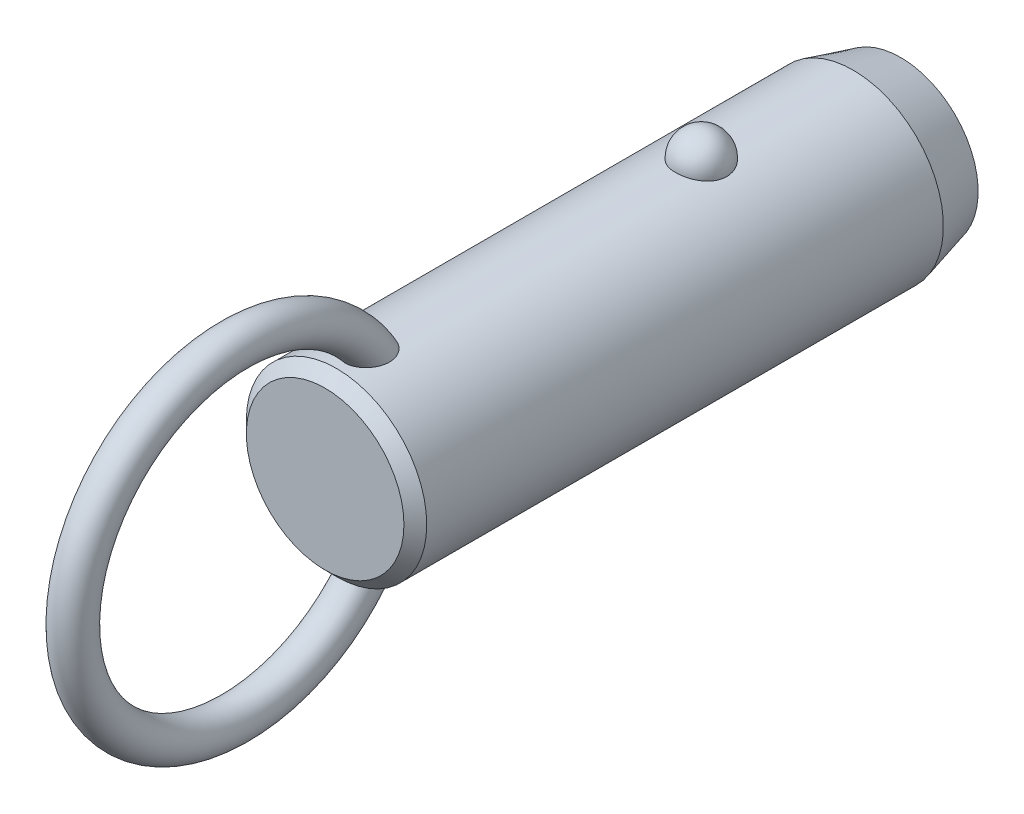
ISO-10303-21;
HEADER;
FILE_DESCRIPTION(('STEP AP214'),'2;1');
FILE_NAME('part.step','',(''),(''),'','','');
FILE_SCHEMA(('AUTOMOTIVE_DESIGN { 1 0 10303 214 1 1 1 1 }'));
ENDSEC;
DATA;
#1=APPLICATION_CONTEXT('core data for automotive mechanical design processes');
#2=APPLICATION_PROTOCOL_DEFINITION('international standard','automotive_design',2000,#1);
#3=PRODUCT_CONTEXT('',#1,'mechanical');
#4=PRODUCT('Part','Part','',(#3));
#5=PRODUCT_RELATED_PRODUCT_CATEGORY('part','',(#4));
#6=PRODUCT_DEFINITION_FORMATION('','',#4);
#7=PRODUCT_DEFINITION_CONTEXT('part definition',#1,'design');
#8=PRODUCT_DEFINITION('design','',#6,#7);
#9=PRODUCT_DEFINITION_SHAPE('','',#8);
#10=(LENGTH_UNIT() NAMED_UNIT(*) SI_UNIT(.MILLI.,.METRE.));
#11=(NAMED_UNIT(*) PLANE_ANGLE_UNIT() SI_UNIT($,.RADIAN.));
#12=(NAMED_UNIT(*) SI_UNIT($,.STERADIAN.) SOLID_ANGLE_UNIT());
#13=UNCERTAINTY_MEASURE_WITH_UNIT(LENGTH_MEASURE(1.E-05),#10,'distance_accuracy_value','');
#14=(GEOMETRIC_REPRESENTATION_CONTEXT(3) GLOBAL_UNCERTAINTY_ASSIGNED_CONTEXT((#13)) GLOBAL_UNIT_ASSIGNED_CONTEXT((#10,
#11,#12)) REPRESENTATION_CONTEXT('',''));
#15=CARTESIAN_POINT('',(0.,0.,0.));
#16=DIRECTION('',(0.,0.,1.));
#17=DIRECTION('',(1.,0.,0.));
#18=AXIS2_PLACEMENT_3D('',#15,#16,#17);
#19=CARTESIAN_POINT('',(0.,0.,27.4));
#20=DIRECTION('',(0.,0.,-1.));
#21=DIRECTION('',(-1.,0.,0.));
#22=AXIS2_PLACEMENT_3D('',#19,#20,#21);
#23=CYLINDRICAL_SURFACE('',#22,9.5);
#24=CARTESIAN_POINT('',(2.67259918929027,9.11631578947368,-2.70000000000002));
#25=CARTESIAN_POINT('',(2.6725968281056,9.11631786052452,-2.54909854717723));
#26=CARTESIAN_POINT('',(2.66030567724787,9.11994722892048,-2.39816735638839));
#27=CARTESIAN_POINT('',(2.6114347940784,9.13405924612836,-2.10058568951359));
#28=CARTESIAN_POINT('',(2.57484658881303,9.14454428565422,-1.95393672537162));
#29=CARTESIAN_POINT('',(2.47830875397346,9.17117631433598,-1.66916069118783));
#30=CARTESIAN_POINT('',(2.41836936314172,9.18732082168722,-1.53102991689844));
#31=CARTESIAN_POINT('',(2.27661331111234,9.22346780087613,-1.26705393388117));
#32=CARTESIAN_POINT('',(2.19479699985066,9.24347021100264,-1.14120852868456));
#33=CARTESIAN_POINT('',(2.01085282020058,9.28522401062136,-0.904632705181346));
#34=CARTESIAN_POINT('',(1.90862396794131,9.30698376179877,-0.793982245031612));
#35=CARTESIAN_POINT('',(1.6867437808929,9.34973971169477,-0.591607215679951));
#36=CARTESIAN_POINT('',(1.56709244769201,9.37073591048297,-0.499882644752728));
#37=CARTESIAN_POINT('',(1.31393976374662,9.40956370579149,-0.338167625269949));
#38=CARTESIAN_POINT('',(1.18048026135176,9.42740444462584,-0.268113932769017));
#39=CARTESIAN_POINT('',(0.903154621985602,9.45799906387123,-0.151390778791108));
#40=CARTESIAN_POINT('',(0.759289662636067,9.47075351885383,-0.104718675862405));
#41=CARTESIAN_POINT('',(0.46807402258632,9.48956256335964,-0.0367633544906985));
#42=CARTESIAN_POINT('',(0.320836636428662,9.49573643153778,-0.0150275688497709));
#43=CARTESIAN_POINT('',(0.02467145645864,9.50112183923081,0.00396199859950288));
#44=CARTESIAN_POINT('',(-0.124256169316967,9.50033406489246,0.00121819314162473));
#45=CARTESIAN_POINT('',(-0.417264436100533,9.4919475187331,-0.0284441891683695));
#46=CARTESIAN_POINT('',(-0.561384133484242,9.48444885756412,-0.0550074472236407));
#47=CARTESIAN_POINT('',(-0.842986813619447,9.46357853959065,-0.131064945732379));
#48=CARTESIAN_POINT('',(-0.98046968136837,9.450206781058,-0.180559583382));
#49=CARTESIAN_POINT('',(-1.24585005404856,9.41890822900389,-0.301476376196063));
#50=CARTESIAN_POINT('',(-1.37368611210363,9.40095498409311,-0.373026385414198));
#51=CARTESIAN_POINT('',(-1.61552738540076,9.36242964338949,-0.536025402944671));
#52=CARTESIAN_POINT('',(-1.72953116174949,9.34185727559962,-0.627476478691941));
#53=CARTESIAN_POINT('',(-1.9429225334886,9.29984568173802,-0.829844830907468));
#54=CARTESIAN_POINT('',(-2.04198021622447,9.27839736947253,-0.941108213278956));
#55=CARTESIAN_POINT('',(-2.2202646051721,9.23735994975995,-1.17883414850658));
#56=CARTESIAN_POINT('',(-2.29948985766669,9.21777097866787,-1.30529781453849));
#57=CARTESIAN_POINT('',(-2.43697287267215,9.18238994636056,-1.57158566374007));
#58=CARTESIAN_POINT('',(-2.49497068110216,9.16664569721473,-1.71155057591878));
#59=CARTESIAN_POINT('',(-2.5872073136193,9.14104303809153,-1.99961197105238));
#60=CARTESIAN_POINT('',(-2.62144683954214,9.13118445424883,-2.1477082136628));
#61=CARTESIAN_POINT('',(-2.66521466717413,9.11850622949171,-2.44715424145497));
#62=CARTESIAN_POINT('',(-2.67484831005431,9.11565658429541,-2.59848735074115));
#63=CARTESIAN_POINT('',(-2.66946735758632,9.11723375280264,-2.90067317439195));
#64=CARTESIAN_POINT('',(-2.65445345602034,9.12166036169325,-3.05152590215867));
#65=CARTESIAN_POINT('',(-2.6002971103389,9.13724422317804,-3.34766110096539));
#66=CARTESIAN_POINT('',(-2.56127978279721,9.14836656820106,-3.49296833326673));
#67=CARTESIAN_POINT('',(-2.46018844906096,9.17606676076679,-3.77477535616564));
#68=CARTESIAN_POINT('',(-2.39811349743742,9.19264483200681,-3.91127478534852));
#69=CARTESIAN_POINT('',(-2.25202303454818,9.22952198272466,-4.17244273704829));
#70=CARTESIAN_POINT('',(-2.16788714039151,9.24984129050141,-4.29704106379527));
#71=CARTESIAN_POINT('',(-1.9799408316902,9.29188255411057,-4.53013066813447));
#72=CARTESIAN_POINT('',(-1.87612963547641,9.31360456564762,-4.63862130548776));
#73=CARTESIAN_POINT('',(-1.65105429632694,9.35612959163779,-4.83690299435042));
#74=CARTESIAN_POINT('',(-1.52972405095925,9.37692871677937,-4.9266199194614));
#75=CARTESIAN_POINT('',(-1.27318250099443,9.41518970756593,-5.08429106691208));
#76=CARTESIAN_POINT('',(-1.13797219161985,9.432651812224,-5.15224684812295));
#77=CARTESIAN_POINT('',(-0.859280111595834,9.46208255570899,-5.26371827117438));
#78=CARTESIAN_POINT('',(-0.715925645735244,9.47411833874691,-5.30753421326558));
#79=CARTESIAN_POINT('',(-0.423550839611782,9.4916822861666,-5.37076321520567));
#80=CARTESIAN_POINT('',(-0.274531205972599,9.49721125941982,-5.39017930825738));
#81=CARTESIAN_POINT('',(0.0218446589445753,9.50110860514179,-5.40390587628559));
#82=CARTESIAN_POINT('',(0.16917707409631,9.49961381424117,-5.39869609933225));
#83=CARTESIAN_POINT('',(0.460808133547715,9.48993906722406,-5.36441955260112));
#84=CARTESIAN_POINT('',(0.605106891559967,9.48175936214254,-5.33535367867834));
#85=CARTESIAN_POINT('',(0.886027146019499,9.4596376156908,-5.25435587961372));
#86=CARTESIAN_POINT('',(1.02267710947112,9.44571881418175,-5.20251612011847));
#87=CARTESIAN_POINT('',(1.28523827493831,9.41358993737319,-5.07741549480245));
#88=CARTESIAN_POINT('',(1.41114877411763,9.39537958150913,-5.00415322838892));
#89=CARTESIAN_POINT('',(1.65085227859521,9.3562644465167,-4.8368459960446));
#90=CARTESIAN_POINT('',(1.76442346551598,9.33532178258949,-4.74249218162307));
#91=CARTESIAN_POINT('',(1.97425672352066,9.29321198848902,-4.53620389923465));
#92=CARTESIAN_POINT('',(2.07051582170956,9.27204482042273,-4.42426641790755));
#93=CARTESIAN_POINT('',(2.24490086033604,9.23139221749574,-4.18363183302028));
#94=CARTESIAN_POINT('',(2.32267019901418,9.21194380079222,-4.05466990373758));
#95=CARTESIAN_POINT('',(2.45584092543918,9.1773419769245,-3.78517836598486));
#96=CARTESIAN_POINT('',(2.51124979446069,9.16218713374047,-3.644652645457));
#97=CARTESIAN_POINT('',(2.59380876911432,9.13913522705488,-3.37104301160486));
#98=CARTESIAN_POINT('',(2.62330266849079,9.13064624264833,-3.23871053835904));
#99=CARTESIAN_POINT('',(2.66269870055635,9.11923566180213,-2.97092664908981));
#100=CARTESIAN_POINT('',(2.67260130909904,9.11631393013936,-2.83547530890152));
#101=CARTESIAN_POINT('',(2.67259918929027,9.11631578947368,-2.70000000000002));
#102=B_SPLINE_CURVE_WITH_KNOTS('',3,(#24,#25,#26,#27,#28,#29,#30,#31,#32,#33,#34,#35,#36,#37,
#38,#39,#40,#41,#42,#43,#44,#45,#46,#47,#48,#49,#50,#51,#52,#53,#54,#55,#56,#57,#58,#59,#60,#61,
#62,#63,#64,#65,#66,#67,#68,#69,#70,#71,#72,#73,#74,#75,#76,#77,#78,#79,#80,#81,#82,#83,#84,#85,
#86,#87,#88,#89,#90,#91,#92,#93,#94,#95,#96,#97,#98,#99,#100,#101),.UNSPECIFIED.,.T.,.F.,(4,2,2,
2,2,2,2,2,2,2,2,2,2,2,2,2,2,2,2,2,2,2,2,2,2,2,2,2,2,2,2,2,2,2,2,2,2,2,4),(0.,0.452217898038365,
0.904593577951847,1.35677112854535,1.80894144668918,2.26340676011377,2.71787203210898,
3.17099820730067,3.62407318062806,4.0687883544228,4.51345969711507,4.95160616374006,
5.38976021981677,5.83050358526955,6.27129275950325,6.72071308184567,7.17016633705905,
7.62495278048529,8.07972578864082,8.53254856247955,8.98535859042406,9.43582813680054,
9.88631615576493,10.3393155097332,10.7923328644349,11.2471065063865,11.7018475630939,
12.150795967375,12.5996885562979,13.0398725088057,13.4800399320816,13.9184421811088,
14.3568730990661,14.802202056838,15.2476074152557,15.7010097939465,16.1542603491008,
16.5602594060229,16.9662486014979),.UNSPECIFIED.);
#103=CARTESIAN_POINT('',(2.67259918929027,9.11631578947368,-2.70000000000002));
#104=VERTEX_POINT('',#103);
#105=EDGE_CURVE('E41',#104,#104,#102,.T.);
#106=ORIENTED_EDGE('',*,*,#105,.T.);
#107=EDGE_LOOP('',(#106));
#108=FACE_BOUND('',#107,.T.);
#109=CARTESIAN_POINT('',(0.,0.,35.72));
#110=DIRECTION('',(0.,0.,1.));
#111=DIRECTION('',(1.,0.,0.));
#112=AXIS2_PLACEMENT_3D('',#109,#110,#111);
#113=CIRCLE('',#112,9.5);
#114=CARTESIAN_POINT('',(9.5,0.,35.72));
#115=VERTEX_POINT('',#114);
#116=EDGE_CURVE('E10',#115,#115,#113,.F.);
#117=ORIENTED_EDGE('',*,*,#116,.T.);
#118=EDGE_LOOP('',(#117));
#119=FACE_BOUND('',#118,.T.);
#120=CARTESIAN_POINT('',(-0.69706210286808,-9.47439269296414,30.0678088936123));
#121=CARTESIAN_POINT('',(-0.799579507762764,-9.46685146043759,30.1074823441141));
#122=CARTESIAN_POINT('',(-0.898575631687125,-9.45788043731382,30.1559309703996));
#123=CARTESIAN_POINT('',(-1.08670047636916,-9.43811593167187,30.2688685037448));
#124=CARTESIAN_POINT('',(-1.17583204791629,-9.42732297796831,30.3333527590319));
#125=CARTESIAN_POINT('',(-1.34179806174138,-9.40513672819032,30.4762099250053));
#126=CARTESIAN_POINT('',(-1.41865133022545,-9.39374438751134,30.554561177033));
#127=CARTESIAN_POINT('',(-1.5586004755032,-9.37154196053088,30.7227524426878));
#128=CARTESIAN_POINT('',(-1.62169476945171,-9.3607319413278,30.8125937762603));
#129=CARTESIAN_POINT('',(-1.73527695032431,-9.34035749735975,31.0045001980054));
#130=CARTESIAN_POINT('',(-1.7852226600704,-9.33085270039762,31.1068910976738));
#131=CARTESIAN_POINT('',(-1.86924997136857,-9.3143834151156,31.318148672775));
#132=CARTESIAN_POINT('',(-1.90332570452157,-9.30741986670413,31.4270177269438));
#133=CARTESIAN_POINT('',(-1.95893603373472,-9.29588482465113,31.6604730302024));
#134=CARTESIAN_POINT('',(-1.97872420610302,-9.29165182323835,31.7854890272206));
#135=CARTESIAN_POINT('',(-2.00062129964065,-9.28695978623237,32.0370805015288));
#136=CARTESIAN_POINT('',(-2.00272284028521,-9.28650232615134,32.163656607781));
#137=CARTESIAN_POINT('',(-1.98958876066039,-9.28932750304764,32.4368157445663));
#138=CARTESIAN_POINT('',(-1.97143366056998,-9.2932400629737,32.5832519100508));
#139=CARTESIAN_POINT('',(-1.91479925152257,-9.30507151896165,32.8720629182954));
#140=CARTESIAN_POINT('',(-1.87629122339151,-9.31299607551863,33.0144317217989));
#141=CARTESIAN_POINT('',(-1.7722568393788,-9.33340232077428,33.3151725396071));
#142=CARTESIAN_POINT('',(-1.70334898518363,-9.34641636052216,33.4723691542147));
#143=CARTESIAN_POINT('',(-1.58111062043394,-9.36759153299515,33.6975171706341));
#144=CARTESIAN_POINT('',(-1.53721459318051,-9.37492619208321,33.7707968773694));
#145=CARTESIAN_POINT('',(-1.4430263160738,-9.38988566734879,33.9130740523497));
#146=CARTESIAN_POINT('',(-1.39273721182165,-9.39751033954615,33.9820736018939));
#147=CARTESIAN_POINT('',(-1.26775962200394,-9.41530678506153,34.1369832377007));
#148=CARTESIAN_POINT('',(-1.19052326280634,-9.42548108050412,34.2208712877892));
#149=CARTESIAN_POINT('',(-1.0242024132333,-9.44499825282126,34.3760086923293));
#150=CARTESIAN_POINT('',(-0.935139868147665,-9.45434261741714,34.4472808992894));
#151=CARTESIAN_POINT('',(-0.76661041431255,-9.46930670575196,34.5586955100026));
#152=CARTESIAN_POINT('',(-0.689439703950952,-9.47529223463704,34.6022354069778));
#153=CARTESIAN_POINT('',(-0.528942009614,-9.48560294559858,34.6763133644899));
#154=CARTESIAN_POINT('',(-0.445620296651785,-9.48992953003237,34.7068624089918));
#155=CARTESIAN_POINT('',(-0.27390112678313,-9.49644161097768,34.7525792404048));
#156=CARTESIAN_POINT('',(-0.185465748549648,-9.49860811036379,34.76761059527));
#157=CARTESIAN_POINT('',(-0.00734541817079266,-9.5004135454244,34.7801494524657));
#158=CARTESIAN_POINT('',(0.0823387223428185,-9.50005405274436,34.7776678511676));
#159=CARTESIAN_POINT('',(0.247679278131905,-9.49708301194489,34.7569959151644));
#160=CARTESIAN_POINT('',(0.323620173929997,-9.49477609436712,34.7409300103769));
#161=CARTESIAN_POINT('',(0.471981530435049,-9.48855917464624,34.6971726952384));
#162=CARTESIAN_POINT('',(0.544400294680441,-9.48464840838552,34.6694757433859));
#163=CARTESIAN_POINT('',(0.708947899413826,-9.47398336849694,34.5928026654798));
#164=CARTESIAN_POINT('',(0.799149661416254,-9.46671310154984,34.5397745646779));
#165=CARTESIAN_POINT('',(0.9697839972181,-9.4507622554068,34.4199731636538));
#166=CARTESIAN_POINT('',(1.05019415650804,-9.44207854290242,34.3531692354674));
#167=CARTESIAN_POINT('',(1.23092343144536,-9.42051459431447,34.1807596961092));
#168=CARTESIAN_POINT('',(1.32652499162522,-9.40733378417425,34.0702619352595));
#169=CARTESIAN_POINT('',(1.49893121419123,-9.38140745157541,33.8355614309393));
#170=CARTESIAN_POINT('',(1.57571616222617,-9.36866239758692,33.7113445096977));
#171=CARTESIAN_POINT('',(1.71285426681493,-9.34457644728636,33.4493891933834));
#172=CARTESIAN_POINT('',(1.77266365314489,-9.33328726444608,33.3113623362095));
#173=CARTESIAN_POINT('',(1.87239208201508,-9.31379209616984,33.0280515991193));
#174=CARTESIAN_POINT('',(1.91230158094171,-9.3055875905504,32.882764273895));
#175=CARTESIAN_POINT('',(1.9760418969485,-9.29228394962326,32.5620281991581));
#176=CARTESIAN_POINT('',(1.99587438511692,-9.28797202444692,32.3857248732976));
#177=CARTESIAN_POINT('',(2.0029570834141,-9.28645519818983,32.0324146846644));
#178=CARTESIAN_POINT('',(1.99025930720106,-9.28923895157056,31.8554093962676));
#179=CARTESIAN_POINT('',(1.93735479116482,-9.30038134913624,31.5563381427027));
#180=CARTESIAN_POINT('',(1.90576827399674,-9.30697680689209,31.4326679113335));
#181=CARTESIAN_POINT('',(1.82287484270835,-9.32356855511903,31.1923297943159));
#182=CARTESIAN_POINT('',(1.77158213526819,-9.33356239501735,31.0756569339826));
#183=CARTESIAN_POINT('',(1.64885744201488,-9.35602275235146,30.8527061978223));
#184=CARTESIAN_POINT('',(1.57730995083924,-9.36850332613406,30.7464927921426));
#185=CARTESIAN_POINT('',(1.41543264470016,-9.39431873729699,30.5495530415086));
#186=CARTESIAN_POINT('',(1.32510883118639,-9.40765330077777,30.4588217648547));
#187=CARTESIAN_POINT('',(1.13846223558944,-9.43195720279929,30.3050334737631));
#188=CARTESIAN_POINT('',(1.04369890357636,-9.44302894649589,30.2400947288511));
#189=CARTESIAN_POINT('',(0.84396568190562,-9.46296805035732,30.1280388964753));
#190=CARTESIAN_POINT('',(0.739000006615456,-9.4718363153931,30.0809144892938));
#191=CARTESIAN_POINT('',(0.528175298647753,-9.48586140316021,30.0081173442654));
#192=CARTESIAN_POINT('',(0.422686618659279,-9.49119633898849,29.9814024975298));
#193=CARTESIAN_POINT('',(0.208590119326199,-9.49831365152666,29.9460137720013));
#194=CARTESIAN_POINT('',(0.0999817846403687,-9.500095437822,29.9373428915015));
#195=CARTESIAN_POINT('',(-0.126104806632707,-9.49988861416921,29.9383501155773));
#196=CARTESIAN_POINT('',(-0.243578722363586,-9.49757821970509,29.9495942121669));
#197=CARTESIAN_POINT('',(-0.474390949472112,-9.48885165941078,29.993167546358));
#198=CARTESIAN_POINT('',(-0.58772905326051,-9.48243528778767,30.0254978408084));
#199=CARTESIAN_POINT('',(-0.69706210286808,-9.47439269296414,30.0678088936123));
#200=B_SPLINE_CURVE_WITH_KNOTS('',3,(#120,#121,#122,#123,#124,#125,#126,#127,#128,#129,#130,
#131,#132,#133,#134,#135,#136,#137,#138,#139,#140,#141,#142,#143,#144,#145,#146,#147,#148,#149,
#150,#151,#152,#153,#154,#155,#156,#157,#158,#159,#160,#161,#162,#163,#164,#165,#166,#167,#168,
#169,#170,#171,#172,#173,#174,#175,#176,#177,#178,#179,#180,#181,#182,#183,#184,#185,#186,#187,
#188,#189,#190,#191,#192,#193,#194,#195,#196,#197,#198,#199),.UNSPECIFIED.,.T.,.F.,(4,2,2,2,2,2,
2,2,2,2,2,2,2,2,2,2,2,2,2,2,2,2,2,2,2,2,2,2,2,2,2,2,2,2,2,2,2,2,2,4),(0.,0.330119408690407,
0.660143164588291,0.989655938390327,1.31920659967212,1.66074728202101,2.00241415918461,
2.38088696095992,2.75951768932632,3.20065679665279,3.64242004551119,4.15620996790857,
4.41314162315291,4.66994734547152,5.01228664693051,5.35399933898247,5.61943037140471,
5.88463652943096,6.15215502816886,6.41950709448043,6.65144391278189,6.88349136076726,
7.19641200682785,7.51003602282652,7.94779711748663,8.38601491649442,8.83699707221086,
9.28819530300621,9.81778662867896,10.3465317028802,10.7284172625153,11.1100280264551,
11.4938603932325,11.8775702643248,12.2220189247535,12.5663259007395,12.8915939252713,
13.2169159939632,13.5689650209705,13.9210316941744),.UNSPECIFIED.);
#201=CARTESIAN_POINT('',(-0.69706210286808,-9.47439269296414,30.0678088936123));
#202=VERTEX_POINT('',#201);
#203=EDGE_CURVE('E60',#202,#202,#200,.T.);
#204=ORIENTED_EDGE('',*,*,#203,.T.);
#205=EDGE_LOOP('',(#204));
#206=FACE_BOUND('',#205,.T.);
#207=CARTESIAN_POINT('',(-0.69706210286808,9.47439269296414,30.0678088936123));
#208=CARTESIAN_POINT('',(-0.597792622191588,9.48169483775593,30.0293956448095));
#209=CARTESIAN_POINT('',(-0.495106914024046,9.48766580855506,29.9991682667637));
#210=CARTESIAN_POINT('',(-0.285876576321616,9.49627648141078,29.9560327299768));
#211=CARTESIAN_POINT('',(-0.179324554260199,9.49890941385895,29.9431597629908));
#212=CARTESIAN_POINT('',(0.0344157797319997,9.50053798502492,29.9351666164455));
#213=CARTESIAN_POINT('',(0.141603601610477,9.49953613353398,29.9400341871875));
#214=CARTESIAN_POINT('',(0.353563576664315,9.49401038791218,29.9673654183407));
#215=CARTESIAN_POINT('',(0.45833679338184,9.48948807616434,29.98982117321));
#216=CARTESIAN_POINT('',(0.662493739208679,9.4774236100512,30.0516719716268));
#217=CARTESIAN_POINT('',(0.761881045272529,9.46988348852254,30.0910556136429));
#218=CARTESIAN_POINT('',(0.95260839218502,9.45260382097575,30.1856342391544));
#219=CARTESIAN_POINT('',(1.04394806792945,9.44286417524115,30.2408299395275));
#220=CARTESIAN_POINT('',(1.21712767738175,9.4221176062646,30.3660662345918));
#221=CARTESIAN_POINT('',(1.29885671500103,9.41109835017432,30.4362579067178));
#222=CARTESIAN_POINT('',(1.4497897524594,9.38903310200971,30.588980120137));
#223=CARTESIAN_POINT('',(1.51899278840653,9.37798710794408,30.6715116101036));
#224=CARTESIAN_POINT('',(1.64602857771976,9.35654375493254,30.8497763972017));
#225=CARTESIAN_POINT('',(1.70333052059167,9.34618688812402,30.9458916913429));
#226=CARTESIAN_POINT('',(1.80259341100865,9.32755128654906,31.145897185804));
#227=CARTESIAN_POINT('',(1.84454942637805,9.31927322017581,31.2497898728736));
#228=CARTESIAN_POINT('',(1.91637039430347,9.30478365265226,31.4722131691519));
#229=CARTESIAN_POINT('',(1.944805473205,9.29882552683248,31.5912192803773));
#230=CARTESIAN_POINT('',(1.98449865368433,9.29043398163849,31.8321436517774));
#231=CARTESIAN_POINT('',(1.99574908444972,9.28800213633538,31.9540631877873));
#232=CARTESIAN_POINT('',(2.00275141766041,9.28649645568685,32.2169324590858));
#233=CARTESIAN_POINT('',(1.99588238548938,9.28799035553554,32.3579529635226));
#234=CARTESIAN_POINT('',(1.96270559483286,9.29505517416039,32.6376217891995));
#235=CARTESIAN_POINT('',(1.93637872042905,9.30063010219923,32.776267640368));
#236=CARTESIAN_POINT('',(1.85949176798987,9.31633564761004,33.0725616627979));
#237=CARTESIAN_POINT('',(1.80549792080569,9.3270926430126,33.2292907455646));
#238=CARTESIAN_POINT('',(1.67376869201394,9.3516306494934,33.5322840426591));
#239=CARTESIAN_POINT('',(1.59603181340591,9.36541185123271,33.6785475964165));
#240=CARTESIAN_POINT('',(1.43602774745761,9.39110706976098,33.9258138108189));
#241=CARTESIAN_POINT('',(1.35831795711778,9.40278656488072,34.029791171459));
#242=CARTESIAN_POINT('',(1.18774483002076,9.42585025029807,34.2245347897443));
#243=CARTESIAN_POINT('',(1.09490932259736,9.43723493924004,34.3153247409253));
#244=CARTESIAN_POINT('',(0.921110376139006,9.45552616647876,34.4562033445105));
#245=CARTESIAN_POINT('',(0.843738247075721,9.46281058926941,34.5106563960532));
#246=CARTESIAN_POINT('',(0.681245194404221,9.47589120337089,34.6067117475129));
#247=CARTESIAN_POINT('',(0.59613566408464,9.48168953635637,34.6483325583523));
#248=CARTESIAN_POINT('',(0.433779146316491,9.49038144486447,34.7100899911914));
#249=CARTESIAN_POINT('',(0.357459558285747,9.49359170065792,34.7326013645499));
#250=CARTESIAN_POINT('',(0.202074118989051,9.49816761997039,34.7645745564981));
#251=CARTESIAN_POINT('',(0.12301025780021,9.49953459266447,34.7740456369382));
#252=CARTESIAN_POINT('',(-0.03573724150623,9.50026497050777,34.7791143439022));
#253=CARTESIAN_POINT('',(-0.115421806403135,9.49962433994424,34.7746840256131));
#254=CARTESIAN_POINT('',(-0.272823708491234,9.49640854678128,34.7522962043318));
#255=CARTESIAN_POINT('',(-0.350540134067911,9.4938325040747,34.7343325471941));
#256=CARTESIAN_POINT('',(-0.500580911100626,9.4870946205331,34.6868028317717));
#257=CARTESIAN_POINT('',(-0.572979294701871,9.48296359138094,34.6574618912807));
#258=CARTESIAN_POINT('',(-0.712864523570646,9.47347609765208,34.5890087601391));
#259=CARTESIAN_POINT('',(-0.7803490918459,9.46811906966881,34.5498920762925));
#260=CARTESIAN_POINT('',(-0.946309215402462,9.45329720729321,34.439432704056));
#261=CARTESIAN_POINT('',(-1.04090230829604,9.44321512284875,34.3623297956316));
#262=CARTESIAN_POINT('',(-1.21661929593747,9.42219227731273,34.1940971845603));
#263=CARTESIAN_POINT('',(-1.29770519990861,9.41124921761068,34.1029292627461));
#264=CARTESIAN_POINT('',(-1.4731964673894,9.38563439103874,33.8761621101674));
#265=CARTESIAN_POINT('',(-1.56208878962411,9.37102009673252,33.7362895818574));
#266=CARTESIAN_POINT('',(-1.71623987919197,9.34401559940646,33.4439503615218));
#267=CARTESIAN_POINT('',(-1.7814786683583,9.33162728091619,33.2914731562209));
#268=CARTESIAN_POINT('',(-1.88853837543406,9.31055541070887,32.9756470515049));
#269=CARTESIAN_POINT('',(-1.9299899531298,9.30193076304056,32.8121685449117));
#270=CARTESIAN_POINT('',(-1.98590726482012,9.29015757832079,32.4805268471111));
#271=CARTESIAN_POINT('',(-2.00040705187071,9.2870021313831,32.3123698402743));
#272=CARTESIAN_POINT('',(-1.99964701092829,9.28716218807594,32.0050806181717));
#273=CARTESIAN_POINT('',(-1.98908145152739,9.28945704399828,31.8659362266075));
#274=CARTESIAN_POINT('',(-1.94566294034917,9.29865169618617,31.5911539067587));
#275=CARTESIAN_POINT('',(-1.91282062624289,9.30554929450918,31.455514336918));
#276=CARTESIAN_POINT('',(-1.84582133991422,9.31898248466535,31.2578026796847));
#277=CARTESIAN_POINT('',(-1.8203808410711,9.32400364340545,31.1925830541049));
#278=CARTESIAN_POINT('',(-1.7635051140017,9.33492884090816,31.0649033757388));
#279=CARTESIAN_POINT('',(-1.7320730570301,9.34083241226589,31.0024418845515));
#280=CARTESIAN_POINT('',(-1.66324243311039,9.353333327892,30.8809407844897));
#281=CARTESIAN_POINT('',(-1.62584239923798,9.35993084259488,30.8219020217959));
#282=CARTESIAN_POINT('',(-1.54527678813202,9.37356864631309,30.7079875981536));
#283=CARTESIAN_POINT('',(-1.50211241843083,9.38060884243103,30.6531110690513));
#284=CARTESIAN_POINT('',(-1.37681147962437,9.40004442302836,30.5099619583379));
#285=CARTESIAN_POINT('',(-1.28916358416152,9.41261047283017,30.4264295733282));
#286=CARTESIAN_POINT('',(-1.09996826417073,9.43658180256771,30.2772360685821));
#287=CARTESIAN_POINT('',(-0.99846185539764,9.44799034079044,30.2115238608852));
#288=CARTESIAN_POINT('',(-0.860188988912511,9.46103017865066,30.1394367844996));
#289=CARTESIAN_POINT('',(-0.828141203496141,9.46389141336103,30.1238511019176));
#290=CARTESIAN_POINT('',(-0.763210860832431,9.46934915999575,30.0944734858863));
#291=CARTESIAN_POINT('',(-0.730328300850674,9.47194567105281,30.0806815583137));
#292=CARTESIAN_POINT('',(-0.69706210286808,9.47439269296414,30.0678088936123));
#293=B_SPLINE_CURVE_WITH_KNOTS('',3,(#207,#208,#209,#210,#211,#212,#213,#214,#215,#216,#217,
#218,#219,#220,#221,#222,#223,#224,#225,#226,#227,#228,#229,#230,#231,#232,#233,#234,#235,#236,
#237,#238,#239,#240,#241,#242,#243,#244,#245,#246,#247,#248,#249,#250,#251,#252,#253,#254,#255,
#256,#257,#258,#259,#260,#261,#262,#263,#264,#265,#266,#267,#268,#269,#270,#271,#272,#273,#274,
#275,#276,#277,#278,#279,#280,#281,#282,#283,#284,#285,#286,#287,#288,#289,#290,#291,#292),
.UNSPECIFIED.,.T.,.F.,(4,2,2,2,2,2,2,2,2,2,2,2,2,2,2,2,2,2,2,2,2,2,2,2,2,2,2,2,2,2,2,2,2,2,2,2,
2,2,2,2,2,2,4),(0.,0.319942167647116,0.640532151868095,0.960900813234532,1.28112555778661,
1.60113495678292,1.92115886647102,2.24457323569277,2.56801248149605,2.90371927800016,
3.23953387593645,3.60560313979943,3.97183576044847,4.393836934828,4.81625324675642,
5.31257045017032,5.80891895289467,6.19868344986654,6.58773876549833,6.87145417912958,
7.15475838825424,7.39263751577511,7.63034760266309,7.8685358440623,8.10683246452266,
8.34063661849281,8.57454843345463,8.93983939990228,9.30614105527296,9.80266668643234,
10.2996107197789,10.8040753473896,11.3079021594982,11.7249776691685,12.1418541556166,
12.3521485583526,12.562331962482,12.7725671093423,12.9827582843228,13.3458276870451,
13.7078449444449,13.8150604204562,13.9222762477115),.UNSPECIFIED.);
#294=CARTESIAN_POINT('',(-0.69706210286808,9.47439269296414,30.0678088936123));
#295=VERTEX_POINT('',#294);
#296=EDGE_CURVE('E68',#295,#295,#293,.T.);
#297=ORIENTED_EDGE('',*,*,#296,.T.);
#298=EDGE_LOOP('',(#297));
#299=FACE_BOUND('',#298,.T.);
#300=CARTESIAN_POINT('',(0.,0.,-18.7));
#301=DIRECTION('',(0.,0.,-1.));
#302=DIRECTION('',(-1.,0.,0.));
#303=AXIS2_PLACEMENT_3D('',#300,#301,#302);
#304=CIRCLE('',#303,9.5);
#305=CARTESIAN_POINT('',(-9.5,0.,-18.7));
#306=VERTEX_POINT('',#305);
#307=EDGE_CURVE('E57',#306,#306,#304,.F.);
#308=ORIENTED_EDGE('',*,*,#307,.T.);
#309=EDGE_LOOP('',(#308));
#310=FACE_BOUND('',#309,.T.);
#311=ADVANCED_FACE('F37',(#108,#119,#206,#299,#310),#23,.T.);
#312=CARTESIAN_POINT('',(0.,0.,-23.7));
#313=DIRECTION('',(0.,0.,-1.));
#314=DIRECTION('',(-1.,0.,0.));
#315=AXIS2_PLACEMENT_3D('',#312,#313,#314);
#316=PLANE('',#315);
#317=CARTESIAN_POINT('',(0.,0.,-23.7));
#318=DIRECTION('',(0.,0.,-1.));
#319=DIRECTION('',(-1.,0.,0.));
#320=AXIS2_PLACEMENT_3D('',#317,#318,#319);
#321=CIRCLE('',#320,8.16025403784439);
#322=CARTESIAN_POINT('',(-8.16025403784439,0.,-23.7));
#323=VERTEX_POINT('',#322);
#324=EDGE_CURVE('E67',#323,#323,#321,.T.);
#325=ORIENTED_EDGE('',*,*,#324,.T.);
#326=EDGE_LOOP('',(#325));
#327=FACE_BOUND('',#326,.T.);
#328=ADVANCED_FACE('F86',(#327),#316,.T.);
#329=CARTESIAN_POINT('',(0.,0.,-23.7));
#330=DIRECTION('',(0.,0.,1.));
#331=DIRECTION('',(1.,0.,0.));
#332=AXIS2_PLACEMENT_3D('',#329,#330,#331);
#333=CONICAL_SURFACE('',#332,8.16025403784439,0.261799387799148);
#334=ORIENTED_EDGE('',*,*,#307,.F.);
#335=EDGE_LOOP('',(#334));
#336=FACE_BOUND('',#335,.T.);
#337=ORIENTED_EDGE('',*,*,#324,.F.);
#338=EDGE_LOOP('',(#337));
#339=FACE_BOUND('',#338,.T.);
#340=ADVANCED_FACE('F84',(#336,#339),#333,.T.);
#341=CARTESIAN_POINT('',(0.,0.,36.92));
#342=DIRECTION('',(0.,0.,1.));
#343=DIRECTION('',(1.,0.,0.));
#344=AXIS2_PLACEMENT_3D('',#341,#342,#343);
#345=PLANE('',#344);
#346=CARTESIAN_POINT('',(0.,0.,36.92));
#347=DIRECTION('',(0.,0.,1.));
#348=DIRECTION('',(1.,0.,0.));
#349=AXIS2_PLACEMENT_3D('',#346,#347,#348);
#350=CIRCLE('',#349,8.30000000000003);
#351=CARTESIAN_POINT('',(8.30000000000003,0.,36.92));
#352=VERTEX_POINT('',#351);
#353=EDGE_CURVE('E50',#352,#352,#350,.T.);
#354=ORIENTED_EDGE('',*,*,#353,.T.);
#355=EDGE_LOOP('',(#354));
#356=FACE_BOUND('',#355,.T.);
#357=ADVANCED_FACE('F78',(#356),#345,.T.);
#358=CARTESIAN_POINT('',(0.,0.,46.45));
#359=DIRECTION('',(1.,0.,0.));
#360=DIRECTION('',(0.,0.,-1.));
#361=AXIS2_PLACEMENT_3D('',#358,#359,#360);
#362=TOROIDAL_SURFACE('',#361,17.05,2.);
#363=ORIENTED_EDGE('',*,*,#296,.F.);
#364=EDGE_LOOP('',(#363));
#365=FACE_BOUND('',#364,.T.);
#366=ORIENTED_EDGE('',*,*,#203,.F.);
#367=EDGE_LOOP('',(#366));
#368=FACE_BOUND('',#367,.T.);
#369=ADVANCED_FACE('F74',(#365,#368),#362,.T.);
#370=CARTESIAN_POINT('',(0.,0.,36.92));
#371=DIRECTION('',(0.,0.,-1.));
#372=DIRECTION('',(-1.,0.,0.));
#373=AXIS2_PLACEMENT_3D('',#370,#371,#372);
#374=CONICAL_SURFACE('',#373,8.30000000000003,0.785398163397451);
#375=ORIENTED_EDGE('',*,*,#116,.F.);
#376=EDGE_LOOP('',(#375));
#377=FACE_BOUND('',#376,.T.);
#378=ORIENTED_EDGE('',*,*,#353,.F.);
#379=EDGE_LOOP('',(#378));
#380=FACE_BOUND('',#379,.T.);
#381=ADVANCED_FACE('F39',(#377,#380),#374,.T.);
#382=CARTESIAN_POINT('',(0.,9.5,-2.70000000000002));
#383=DIRECTION('',(0.,1.,0.));
#384=DIRECTION('',(0.,0.,1.));
#385=AXIS2_PLACEMENT_3D('',#382,#383,#384);
#386=SPHERICAL_SURFACE('',#385,2.7);
#387=ORIENTED_EDGE('',*,*,#105,.F.);
#388=EDGE_LOOP('',(#387));
#389=FACE_BOUND('',#388,.T.);
#390=ADVANCED_FACE('F80',(#389),#386,.T.);
#391=CLOSED_SHELL('',(#311,#328,#340,#357,#369,#381,#390));
#392=MANIFOLD_SOLID_BREP('B2',#391);
#393=ADVANCED_BREP_SHAPE_REPRESENTATION('',(#18,#392),#14);
#394=SHAPE_DEFINITION_REPRESENTATION(#9,#393);
ENDSEC;
END-ISO-10303-21;
